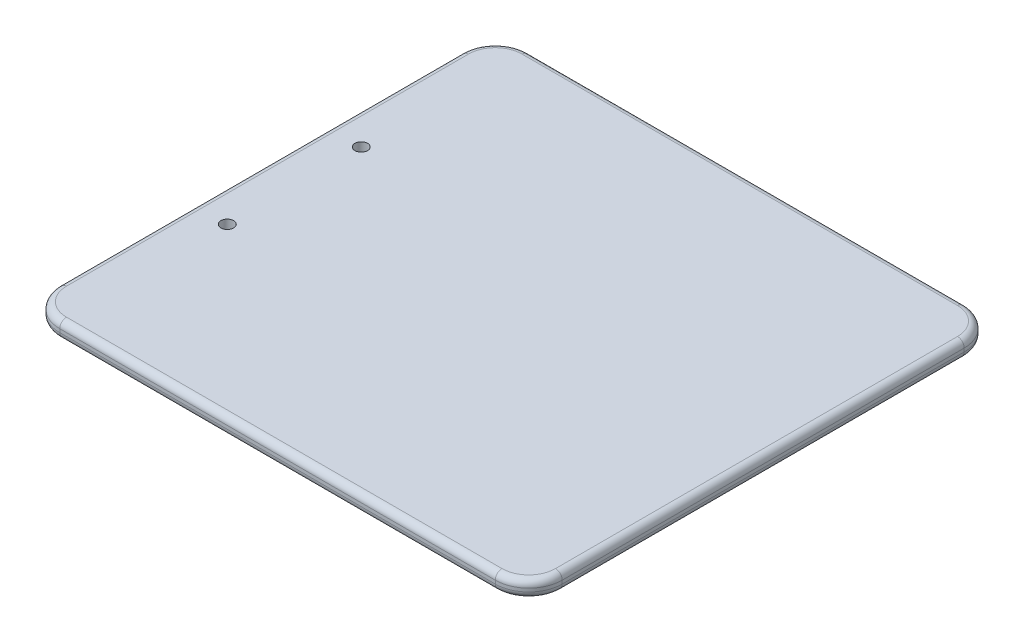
ISO-10303-21;
HEADER;
FILE_DESCRIPTION(('STEP AP214'),'2;1');
FILE_NAME('part.step','',(''),(''),'','','');
FILE_SCHEMA(('AUTOMOTIVE_DESIGN { 1 0 10303 214 1 1 1 1 }'));
ENDSEC;
DATA;
#1=APPLICATION_CONTEXT('core data for automotive mechanical design processes');
#2=APPLICATION_PROTOCOL_DEFINITION('international standard','automotive_design',2000,#1);
#3=PRODUCT_CONTEXT('',#1,'mechanical');
#4=PRODUCT('Part','Part','',(#3));
#5=PRODUCT_RELATED_PRODUCT_CATEGORY('part','',(#4));
#6=PRODUCT_DEFINITION_FORMATION('','',#4);
#7=PRODUCT_DEFINITION_CONTEXT('part definition',#1,'design');
#8=PRODUCT_DEFINITION('design','',#6,#7);
#9=PRODUCT_DEFINITION_SHAPE('','',#8);
#10=(LENGTH_UNIT() NAMED_UNIT(*) SI_UNIT(.MILLI.,.METRE.));
#11=(NAMED_UNIT(*) PLANE_ANGLE_UNIT() SI_UNIT($,.RADIAN.));
#12=(NAMED_UNIT(*) SI_UNIT($,.STERADIAN.) SOLID_ANGLE_UNIT());
#13=UNCERTAINTY_MEASURE_WITH_UNIT(LENGTH_MEASURE(1.E-05),#10,'distance_accuracy_value','');
#14=(GEOMETRIC_REPRESENTATION_CONTEXT(3) GLOBAL_UNCERTAINTY_ASSIGNED_CONTEXT((#13)) GLOBAL_UNIT_ASSIGNED_CONTEXT((#10,
#11,#12)) REPRESENTATION_CONTEXT('',''));
#15=CARTESIAN_POINT('',(0.,0.,0.));
#16=DIRECTION('',(0.,0.,1.));
#17=DIRECTION('',(1.,0.,0.));
#18=AXIS2_PLACEMENT_3D('',#15,#16,#17);
#19=CARTESIAN_POINT('',(75.,-5.,-70.));
#20=DIRECTION('',(0.,-1.,0.));
#21=DIRECTION('',(0.,0.,-1.));
#22=AXIS2_PLACEMENT_3D('',#19,#20,#21);
#23=PLANE('',#22);
#24=CARTESIAN_POINT('',(-65.,-5.,-20.));
#25=DIRECTION('',(0.,-1.,0.));
#26=DIRECTION('',(0.,0.,-1.));
#27=AXIS2_PLACEMENT_3D('',#24,#25,#26);
#28=CIRCLE('',#27,1.89865);
#29=CARTESIAN_POINT('',(-65.,-5.,-21.89865));
#30=VERTEX_POINT('',#29);
#31=EDGE_CURVE('E202',#30,#30,#28,.T.);
#32=ORIENTED_EDGE('',*,*,#31,.F.);
#33=EDGE_LOOP('',(#32));
#34=FACE_BOUND('',#33,.T.);
#35=CARTESIAN_POINT('',(-65.,-5.,20.));
#36=DIRECTION('',(0.,-1.,0.));
#37=DIRECTION('',(0.,0.,-1.));
#38=AXIS2_PLACEMENT_3D('',#35,#36,#37);
#39=CIRCLE('',#38,1.89865);
#40=CARTESIAN_POINT('',(-65.,-5.,18.10135));
#41=VERTEX_POINT('',#40);
#42=EDGE_CURVE('E319',#41,#41,#39,.T.);
#43=ORIENTED_EDGE('',*,*,#42,.F.);
#44=EDGE_LOOP('',(#43));
#45=FACE_BOUND('',#44,.T.);
#46=CARTESIAN_POINT('',(65.,-5.,60.));
#47=DIRECTION('',(0.,-1.,0.));
#48=DIRECTION('',(0.,0.,-1.));
#49=AXIS2_PLACEMENT_3D('',#46,#47,#48);
#50=CIRCLE('',#49,8.);
#51=CARTESIAN_POINT('',(65.,-5.,68.));
#52=VERTEX_POINT('',#51);
#53=CARTESIAN_POINT('',(73.,-5.,60.));
#54=VERTEX_POINT('',#53);
#55=EDGE_CURVE('E220',#52,#54,#50,.F.);
#56=ORIENTED_EDGE('',*,*,#55,.F.);
#57=DIRECTION('',(1.,0.,0.));
#58=VECTOR('',#57,1.);
#59=CARTESIAN_POINT('',(75.,-5.,68.));
#60=LINE('',#59,#58);
#61=CARTESIAN_POINT('',(-65.,-5.,68.));
#62=VERTEX_POINT('',#61);
#63=EDGE_CURVE('E281',#52,#62,#60,.F.);
#64=ORIENTED_EDGE('',*,*,#63,.T.);
#65=CARTESIAN_POINT('',(-65.,-5.,60.));
#66=DIRECTION('',(0.,-1.,0.));
#67=DIRECTION('',(0.,0.,-1.));
#68=AXIS2_PLACEMENT_3D('',#65,#66,#67);
#69=CIRCLE('',#68,8.);
#70=CARTESIAN_POINT('',(-73.,-5.,60.));
#71=VERTEX_POINT('',#70);
#72=EDGE_CURVE('E214',#71,#62,#69,.F.);
#73=ORIENTED_EDGE('',*,*,#72,.F.);
#74=DIRECTION('',(0.,0.,1.));
#75=VECTOR('',#74,1.);
#76=CARTESIAN_POINT('',(-73.,-5.,-70.));
#77=LINE('',#76,#75);
#78=CARTESIAN_POINT('',(-73.,-5.,-60.));
#79=VERTEX_POINT('',#78);
#80=EDGE_CURVE('E186',#71,#79,#77,.F.);
#81=ORIENTED_EDGE('',*,*,#80,.T.);
#82=CARTESIAN_POINT('',(-65.,-5.,-60.));
#83=DIRECTION('',(0.,-1.,0.));
#84=DIRECTION('',(0.,0.,-1.));
#85=AXIS2_PLACEMENT_3D('',#82,#83,#84);
#86=CIRCLE('',#85,8.);
#87=CARTESIAN_POINT('',(-65.,-5.,-68.));
#88=VERTEX_POINT('',#87);
#89=EDGE_CURVE('E192',#88,#79,#86,.F.);
#90=ORIENTED_EDGE('',*,*,#89,.F.);
#91=DIRECTION('',(-1.,0.,0.));
#92=VECTOR('',#91,1.);
#93=CARTESIAN_POINT('',(75.,-5.,-68.));
#94=LINE('',#93,#92);
#95=CARTESIAN_POINT('',(65.,-5.,-68.));
#96=VERTEX_POINT('',#95);
#97=EDGE_CURVE('E181',#88,#96,#94,.F.);
#98=ORIENTED_EDGE('',*,*,#97,.T.);
#99=CARTESIAN_POINT('',(65.,-5.,-60.));
#100=DIRECTION('',(0.,-1.,0.));
#101=DIRECTION('',(0.,0.,-1.));
#102=AXIS2_PLACEMENT_3D('',#99,#100,#101);
#103=CIRCLE('',#102,8.);
#104=CARTESIAN_POINT('',(73.,-5.,-60.));
#105=VERTEX_POINT('',#104);
#106=EDGE_CURVE('E217',#105,#96,#103,.F.);
#107=ORIENTED_EDGE('',*,*,#106,.F.);
#108=DIRECTION('',(0.,0.,-1.));
#109=VECTOR('',#108,1.);
#110=CARTESIAN_POINT('',(73.,-5.,-70.));
#111=LINE('',#110,#109);
#112=EDGE_CURVE('E287',#105,#54,#111,.F.);
#113=ORIENTED_EDGE('',*,*,#112,.T.);
#114=EDGE_LOOP('',(#56,#64,#73,#81,#90,#98,#107,#113));
#115=FACE_BOUND('',#114,.T.);
#116=ADVANCED_FACE('F35',(#34,#45,#115),#23,.T.);
#117=CARTESIAN_POINT('',(75.,0.,-70.));
#118=DIRECTION('',(0.,-1.,0.));
#119=DIRECTION('',(0.,0.,-1.));
#120=AXIS2_PLACEMENT_3D('',#117,#118,#119);
#121=PLANE('',#120);
#122=CARTESIAN_POINT('',(-65.,0.,-20.));
#123=DIRECTION('',(0.,-1.,0.));
#124=DIRECTION('',(0.,0.,-1.));
#125=AXIS2_PLACEMENT_3D('',#122,#123,#124);
#126=CIRCLE('',#125,1.89865);
#127=CARTESIAN_POINT('',(-65.,0.,-21.89865));
#128=VERTEX_POINT('',#127);
#129=EDGE_CURVE('E322',#128,#128,#126,.T.);
#130=ORIENTED_EDGE('',*,*,#129,.T.);
#131=EDGE_LOOP('',(#130));
#132=FACE_BOUND('',#131,.T.);
#133=CARTESIAN_POINT('',(-65.,0.,20.));
#134=DIRECTION('',(0.,-1.,0.));
#135=DIRECTION('',(0.,0.,-1.));
#136=AXIS2_PLACEMENT_3D('',#133,#134,#135);
#137=CIRCLE('',#136,1.89865);
#138=CARTESIAN_POINT('',(-65.,0.,18.10135));
#139=VERTEX_POINT('',#138);
#140=EDGE_CURVE('E316',#139,#139,#137,.T.);
#141=ORIENTED_EDGE('',*,*,#140,.T.);
#142=EDGE_LOOP('',(#141));
#143=FACE_BOUND('',#142,.T.);
#144=CARTESIAN_POINT('',(65.,0.,-60.));
#145=DIRECTION('',(0.,-1.,0.));
#146=DIRECTION('',(0.,0.,-1.));
#147=AXIS2_PLACEMENT_3D('',#144,#145,#146);
#148=CIRCLE('',#147,8.);
#149=CARTESIAN_POINT('',(65.,0.,-68.));
#150=VERTEX_POINT('',#149);
#151=CARTESIAN_POINT('',(73.,0.,-60.));
#152=VERTEX_POINT('',#151);
#153=EDGE_CURVE('E207',#150,#152,#148,.T.);
#154=ORIENTED_EDGE('',*,*,#153,.F.);
#155=DIRECTION('',(-1.,0.,0.));
#156=VECTOR('',#155,1.);
#157=CARTESIAN_POINT('',(-75.,0.,-68.));
#158=LINE('',#157,#156);
#159=CARTESIAN_POINT('',(-65.,0.,-68.));
#160=VERTEX_POINT('',#159);
#161=EDGE_CURVE('E311',#150,#160,#158,.T.);
#162=ORIENTED_EDGE('',*,*,#161,.T.);
#163=CARTESIAN_POINT('',(-65.,0.,-60.));
#164=DIRECTION('',(0.,-1.,0.));
#165=DIRECTION('',(0.,0.,-1.));
#166=AXIS2_PLACEMENT_3D('',#163,#164,#165);
#167=CIRCLE('',#166,8.);
#168=CARTESIAN_POINT('',(-73.,0.,-60.));
#169=VERTEX_POINT('',#168);
#170=EDGE_CURVE('E180',#169,#160,#167,.T.);
#171=ORIENTED_EDGE('',*,*,#170,.F.);
#172=DIRECTION('',(0.,0.,1.));
#173=VECTOR('',#172,1.);
#174=CARTESIAN_POINT('',(-73.,0.,70.));
#175=LINE('',#174,#173);
#176=CARTESIAN_POINT('',(-73.,0.,60.));
#177=VERTEX_POINT('',#176);
#178=EDGE_CURVE('E308',#169,#177,#175,.T.);
#179=ORIENTED_EDGE('',*,*,#178,.T.);
#180=CARTESIAN_POINT('',(-65.,0.,60.));
#181=DIRECTION('',(0.,-1.,0.));
#182=DIRECTION('',(0.,0.,-1.));
#183=AXIS2_PLACEMENT_3D('',#180,#181,#182);
#184=CIRCLE('',#183,8.);
#185=CARTESIAN_POINT('',(-65.,0.,68.));
#186=VERTEX_POINT('',#185);
#187=EDGE_CURVE('E205',#186,#177,#184,.T.);
#188=ORIENTED_EDGE('',*,*,#187,.F.);
#189=DIRECTION('',(1.,0.,0.));
#190=VECTOR('',#189,1.);
#191=CARTESIAN_POINT('',(75.,0.,68.));
#192=LINE('',#191,#190);
#193=CARTESIAN_POINT('',(65.,0.,68.));
#194=VERTEX_POINT('',#193);
#195=EDGE_CURVE('E305',#186,#194,#192,.T.);
#196=ORIENTED_EDGE('',*,*,#195,.T.);
#197=CARTESIAN_POINT('',(65.,0.,60.));
#198=DIRECTION('',(0.,-1.,0.));
#199=DIRECTION('',(0.,0.,-1.));
#200=AXIS2_PLACEMENT_3D('',#197,#198,#199);
#201=CIRCLE('',#200,8.);
#202=CARTESIAN_POINT('',(73.,0.,60.));
#203=VERTEX_POINT('',#202);
#204=EDGE_CURVE('E199',#203,#194,#201,.T.);
#205=ORIENTED_EDGE('',*,*,#204,.F.);
#206=DIRECTION('',(0.,0.,-1.));
#207=VECTOR('',#206,1.);
#208=CARTESIAN_POINT('',(73.,0.,-70.));
#209=LINE('',#208,#207);
#210=EDGE_CURVE('E313',#203,#152,#209,.T.);
#211=ORIENTED_EDGE('',*,*,#210,.T.);
#212=EDGE_LOOP('',(#154,#162,#171,#179,#188,#196,#205,#211));
#213=FACE_BOUND('',#212,.T.);
#214=ADVANCED_FACE('F332',(#132,#143,#213),#121,.F.);
#215=CARTESIAN_POINT('',(75.,-5.,70.));
#216=DIRECTION('',(1.,0.,0.));
#217=DIRECTION('',(0.,0.,-1.));
#218=AXIS2_PLACEMENT_3D('',#215,#216,#217);
#219=PLANE('',#218);
#220=DIRECTION('',(0.,0.,-1.));
#221=VECTOR('',#220,1.);
#222=CARTESIAN_POINT('',(75.,-2.,70.));
#223=LINE('',#222,#221);
#224=CARTESIAN_POINT('',(75.,-2.,-60.));
#225=VERTEX_POINT('',#224);
#226=CARTESIAN_POINT('',(75.,-2.,60.));
#227=VERTEX_POINT('',#226);
#228=EDGE_CURVE('E289',#225,#227,#223,.F.);
#229=ORIENTED_EDGE('',*,*,#228,.T.);
#230=DIRECTION('',(0.,1.,0.));
#231=VECTOR('',#230,1.);
#232=CARTESIAN_POINT('',(75.,-5.,60.));
#233=LINE('',#232,#231);
#234=CARTESIAN_POINT('',(75.,-3.,60.));
#235=VERTEX_POINT('',#234);
#236=EDGE_CURVE('E249',#227,#235,#233,.F.);
#237=ORIENTED_EDGE('',*,*,#236,.T.);
#238=DIRECTION('',(0.,0.,-1.));
#239=VECTOR('',#238,1.);
#240=CARTESIAN_POINT('',(75.,-3.,70.));
#241=LINE('',#240,#239);
#242=CARTESIAN_POINT('',(75.,-3.,-60.));
#243=VERTEX_POINT('',#242);
#244=EDGE_CURVE('E167',#235,#243,#241,.T.);
#245=ORIENTED_EDGE('',*,*,#244,.T.);
#246=DIRECTION('',(0.,1.,0.));
#247=VECTOR('',#246,1.);
#248=CARTESIAN_POINT('',(75.,-5.,-60.));
#249=LINE('',#248,#247);
#250=EDGE_CURVE('E247',#243,#225,#249,.T.);
#251=ORIENTED_EDGE('',*,*,#250,.T.);
#252=EDGE_LOOP('',(#229,#237,#245,#251));
#253=FACE_BOUND('',#252,.T.);
#254=ADVANCED_FACE('F355',(#253),#219,.T.);
#255=CARTESIAN_POINT('',(-75.,-5.,70.));
#256=DIRECTION('',(0.,0.,1.));
#257=DIRECTION('',(1.,0.,0.));
#258=AXIS2_PLACEMENT_3D('',#255,#256,#257);
#259=PLANE('',#258);
#260=DIRECTION('',(1.,0.,0.));
#261=VECTOR('',#260,1.);
#262=CARTESIAN_POINT('',(-75.,-2.,70.));
#263=LINE('',#262,#261);
#264=CARTESIAN_POINT('',(65.,-2.,70.));
#265=VERTEX_POINT('',#264);
#266=CARTESIAN_POINT('',(-65.,-2.,70.));
#267=VERTEX_POINT('',#266);
#268=EDGE_CURVE('E301',#265,#267,#263,.F.);
#269=ORIENTED_EDGE('',*,*,#268,.T.);
#270=DIRECTION('',(0.,1.,0.));
#271=VECTOR('',#270,1.);
#272=CARTESIAN_POINT('',(-65.,-5.,70.));
#273=LINE('',#272,#271);
#274=CARTESIAN_POINT('',(-65.,-3.,70.));
#275=VERTEX_POINT('',#274);
#276=EDGE_CURVE('E245',#267,#275,#273,.F.);
#277=ORIENTED_EDGE('',*,*,#276,.T.);
#278=DIRECTION('',(1.,0.,0.));
#279=VECTOR('',#278,1.);
#280=CARTESIAN_POINT('',(-75.,-3.,70.));
#281=LINE('',#280,#279);
#282=CARTESIAN_POINT('',(65.,-3.,70.));
#283=VERTEX_POINT('',#282);
#284=EDGE_CURVE('E283',#275,#283,#281,.T.);
#285=ORIENTED_EDGE('',*,*,#284,.T.);
#286=DIRECTION('',(0.,1.,0.));
#287=VECTOR('',#286,1.);
#288=CARTESIAN_POINT('',(65.,-5.,70.));
#289=LINE('',#288,#287);
#290=EDGE_CURVE('E243',#283,#265,#289,.T.);
#291=ORIENTED_EDGE('',*,*,#290,.T.);
#292=EDGE_LOOP('',(#269,#277,#285,#291));
#293=FACE_BOUND('',#292,.T.);
#294=ADVANCED_FACE('F357',(#293),#259,.T.);
#295=CARTESIAN_POINT('',(-75.,-5.,70.));
#296=DIRECTION('',(-1.,0.,0.));
#297=DIRECTION('',(0.,0.,1.));
#298=AXIS2_PLACEMENT_3D('',#295,#296,#297);
#299=PLANE('',#298);
#300=DIRECTION('',(0.,0.,1.));
#301=VECTOR('',#300,1.);
#302=CARTESIAN_POINT('',(-75.,-3.,70.));
#303=LINE('',#302,#301);
#304=CARTESIAN_POINT('',(-75.,-3.,-60.));
#305=VERTEX_POINT('',#304);
#306=CARTESIAN_POINT('',(-75.,-3.,60.));
#307=VERTEX_POINT('',#306);
#308=EDGE_CURVE('E299',#305,#307,#303,.T.);
#309=ORIENTED_EDGE('',*,*,#308,.T.);
#310=DIRECTION('',(0.,1.,0.));
#311=VECTOR('',#310,1.);
#312=CARTESIAN_POINT('',(-75.,-5.,60.));
#313=LINE('',#312,#311);
#314=CARTESIAN_POINT('',(-75.,-2.,60.));
#315=VERTEX_POINT('',#314);
#316=EDGE_CURVE('E241',#307,#315,#313,.T.);
#317=ORIENTED_EDGE('',*,*,#316,.T.);
#318=DIRECTION('',(0.,0.,1.));
#319=VECTOR('',#318,1.);
#320=CARTESIAN_POINT('',(-75.,-2.,-70.));
#321=LINE('',#320,#319);
#322=CARTESIAN_POINT('',(-75.,-2.,-60.));
#323=VERTEX_POINT('',#322);
#324=EDGE_CURVE('E297',#315,#323,#321,.F.);
#325=ORIENTED_EDGE('',*,*,#324,.T.);
#326=DIRECTION('',(0.,1.,0.));
#327=VECTOR('',#326,1.);
#328=CARTESIAN_POINT('',(-75.,-5.,-60.));
#329=LINE('',#328,#327);
#330=EDGE_CURVE('E160',#323,#305,#329,.F.);
#331=ORIENTED_EDGE('',*,*,#330,.T.);
#332=EDGE_LOOP('',(#309,#317,#325,#331));
#333=FACE_BOUND('',#332,.T.);
#334=ADVANCED_FACE('F360',(#333),#299,.T.);
#335=CARTESIAN_POINT('',(-75.,-5.,-70.));
#336=DIRECTION('',(0.,0.,-1.));
#337=DIRECTION('',(-1.,0.,0.));
#338=AXIS2_PLACEMENT_3D('',#335,#336,#337);
#339=PLANE('',#338);
#340=DIRECTION('',(-1.,0.,0.));
#341=VECTOR('',#340,1.);
#342=CARTESIAN_POINT('',(75.,-2.,-70.));
#343=LINE('',#342,#341);
#344=CARTESIAN_POINT('',(-65.,-2.,-70.));
#345=VERTEX_POINT('',#344);
#346=CARTESIAN_POINT('',(65.,-2.,-70.));
#347=VERTEX_POINT('',#346);
#348=EDGE_CURVE('E152',#345,#347,#343,.F.);
#349=ORIENTED_EDGE('',*,*,#348,.T.);
#350=DIRECTION('',(0.,1.,0.));
#351=VECTOR('',#350,1.);
#352=CARTESIAN_POINT('',(65.,-5.,-70.));
#353=LINE('',#352,#351);
#354=CARTESIAN_POINT('',(65.,-3.,-70.));
#355=VERTEX_POINT('',#354);
#356=EDGE_CURVE('E44',#347,#355,#353,.F.);
#357=ORIENTED_EDGE('',*,*,#356,.T.);
#358=DIRECTION('',(-1.,0.,0.));
#359=VECTOR('',#358,1.);
#360=CARTESIAN_POINT('',(-75.,-3.,-70.));
#361=LINE('',#360,#359);
#362=CARTESIAN_POINT('',(-65.,-3.,-70.));
#363=VERTEX_POINT('',#362);
#364=EDGE_CURVE('E155',#355,#363,#361,.T.);
#365=ORIENTED_EDGE('',*,*,#364,.T.);
#366=DIRECTION('',(0.,1.,0.));
#367=VECTOR('',#366,1.);
#368=CARTESIAN_POINT('',(-65.,-5.,-70.));
#369=LINE('',#368,#367);
#370=EDGE_CURVE('E150',#363,#345,#369,.T.);
#371=ORIENTED_EDGE('',*,*,#370,.T.);
#372=EDGE_LOOP('',(#349,#357,#365,#371));
#373=FACE_BOUND('',#372,.T.);
#374=ADVANCED_FACE('F151',(#373),#339,.T.);
#375=CARTESIAN_POINT('',(75.,-2.,-68.));
#376=DIRECTION('',(1.,0.,0.));
#377=DIRECTION('',(0.,0.,-1.));
#378=AXIS2_PLACEMENT_3D('',#375,#376,#377);
#379=CYLINDRICAL_SURFACE('',#378,2.);
#380=ORIENTED_EDGE('',*,*,#161,.F.);
#381=CARTESIAN_POINT('',(65.,-2.,-68.));
#382=DIRECTION('',(-1.,0.,0.));
#383=DIRECTION('',(0.,0.,1.));
#384=AXIS2_PLACEMENT_3D('',#381,#382,#383);
#385=CIRCLE('',#384,2.);
#386=EDGE_CURVE('E11',#150,#347,#385,.T.);
#387=ORIENTED_EDGE('',*,*,#386,.T.);
#388=ORIENTED_EDGE('',*,*,#348,.F.);
#389=CARTESIAN_POINT('',(-65.,-2.,-68.));
#390=DIRECTION('',(1.,0.,0.));
#391=DIRECTION('',(0.,0.,-1.));
#392=AXIS2_PLACEMENT_3D('',#389,#390,#391);
#393=CIRCLE('',#392,2.);
#394=EDGE_CURVE('E166',#345,#160,#393,.T.);
#395=ORIENTED_EDGE('',*,*,#394,.T.);
#396=EDGE_LOOP('',(#380,#387,#388,#395));
#397=FACE_BOUND('',#396,.T.);
#398=ADVANCED_FACE('F164',(#397),#379,.T.);
#399=CARTESIAN_POINT('',(-73.,-2.,-70.));
#400=DIRECTION('',(0.,0.,-1.));
#401=DIRECTION('',(-1.,0.,0.));
#402=AXIS2_PLACEMENT_3D('',#399,#400,#401);
#403=CYLINDRICAL_SURFACE('',#402,2.);
#404=ORIENTED_EDGE('',*,*,#324,.F.);
#405=CARTESIAN_POINT('',(-73.,-2.,60.));
#406=DIRECTION('',(0.,0.,-1.));
#407=DIRECTION('',(-1.,0.,0.));
#408=AXIS2_PLACEMENT_3D('',#405,#406,#407);
#409=CIRCLE('',#408,2.);
#410=EDGE_CURVE('E227',#315,#177,#409,.T.);
#411=ORIENTED_EDGE('',*,*,#410,.T.);
#412=ORIENTED_EDGE('',*,*,#178,.F.);
#413=CARTESIAN_POINT('',(-73.,-2.,-60.));
#414=DIRECTION('',(0.,0.,1.));
#415=DIRECTION('',(1.,0.,0.));
#416=AXIS2_PLACEMENT_3D('',#413,#414,#415);
#417=CIRCLE('',#416,2.);
#418=EDGE_CURVE('E197',#169,#323,#417,.T.);
#419=ORIENTED_EDGE('',*,*,#418,.T.);
#420=EDGE_LOOP('',(#404,#411,#412,#419));
#421=FACE_BOUND('',#420,.T.);
#422=ADVANCED_FACE('F377',(#421),#403,.T.);
#423=CARTESIAN_POINT('',(73.,-2.,-70.));
#424=DIRECTION('',(0.,0.,1.));
#425=DIRECTION('',(1.,0.,0.));
#426=AXIS2_PLACEMENT_3D('',#423,#424,#425);
#427=CYLINDRICAL_SURFACE('',#426,2.);
#428=ORIENTED_EDGE('',*,*,#228,.F.);
#429=CARTESIAN_POINT('',(73.,-2.,-60.));
#430=DIRECTION('',(0.,0.,1.));
#431=DIRECTION('',(1.,0.,0.));
#432=AXIS2_PLACEMENT_3D('',#429,#430,#431);
#433=CIRCLE('',#432,2.);
#434=EDGE_CURVE('E212',#225,#152,#433,.T.);
#435=ORIENTED_EDGE('',*,*,#434,.T.);
#436=ORIENTED_EDGE('',*,*,#210,.F.);
#437=CARTESIAN_POINT('',(73.,-2.,60.));
#438=DIRECTION('',(0.,0.,-1.));
#439=DIRECTION('',(-1.,0.,0.));
#440=AXIS2_PLACEMENT_3D('',#437,#438,#439);
#441=CIRCLE('',#440,2.);
#442=EDGE_CURVE('E210',#203,#227,#441,.T.);
#443=ORIENTED_EDGE('',*,*,#442,.T.);
#444=EDGE_LOOP('',(#428,#435,#436,#443));
#445=FACE_BOUND('',#444,.T.);
#446=ADVANCED_FACE('F373',(#445),#427,.T.);
#447=CARTESIAN_POINT('',(75.,-2.,68.));
#448=DIRECTION('',(-1.,0.,0.));
#449=DIRECTION('',(0.,0.,1.));
#450=AXIS2_PLACEMENT_3D('',#447,#448,#449);
#451=CYLINDRICAL_SURFACE('',#450,2.);
#452=ORIENTED_EDGE('',*,*,#268,.F.);
#453=CARTESIAN_POINT('',(65.,-2.,68.));
#454=DIRECTION('',(-1.,0.,0.));
#455=DIRECTION('',(0.,0.,1.));
#456=AXIS2_PLACEMENT_3D('',#453,#454,#455);
#457=CIRCLE('',#456,2.);
#458=EDGE_CURVE('E234',#265,#194,#457,.T.);
#459=ORIENTED_EDGE('',*,*,#458,.T.);
#460=ORIENTED_EDGE('',*,*,#195,.F.);
#461=CARTESIAN_POINT('',(-65.,-2.,68.));
#462=DIRECTION('',(1.,0.,0.));
#463=DIRECTION('',(0.,0.,-1.));
#464=AXIS2_PLACEMENT_3D('',#461,#462,#463);
#465=CIRCLE('',#464,2.);
#466=EDGE_CURVE('E232',#186,#267,#465,.T.);
#467=ORIENTED_EDGE('',*,*,#466,.T.);
#468=EDGE_LOOP('',(#452,#459,#460,#467));
#469=FACE_BOUND('',#468,.T.);
#470=ADVANCED_FACE('F370',(#469),#451,.T.);
#471=CARTESIAN_POINT('',(-75.,-3.,68.));
#472=DIRECTION('',(1.,0.,0.));
#473=DIRECTION('',(0.,0.,-1.));
#474=AXIS2_PLACEMENT_3D('',#471,#472,#473);
#475=CYLINDRICAL_SURFACE('',#474,2.);
#476=ORIENTED_EDGE('',*,*,#284,.F.);
#477=CARTESIAN_POINT('',(-65.,-3.,68.));
#478=DIRECTION('',(1.,0.,0.));
#479=DIRECTION('',(0.,0.,-1.));
#480=AXIS2_PLACEMENT_3D('',#477,#478,#479);
#481=CIRCLE('',#480,2.);
#482=EDGE_CURVE('E238',#275,#62,#481,.T.);
#483=ORIENTED_EDGE('',*,*,#482,.T.);
#484=ORIENTED_EDGE('',*,*,#63,.F.);
#485=CARTESIAN_POINT('',(65.,-3.,68.));
#486=DIRECTION('',(-1.,0.,0.));
#487=DIRECTION('',(0.,0.,1.));
#488=AXIS2_PLACEMENT_3D('',#485,#486,#487);
#489=CIRCLE('',#488,2.);
#490=EDGE_CURVE('E236',#52,#283,#489,.T.);
#491=ORIENTED_EDGE('',*,*,#490,.T.);
#492=EDGE_LOOP('',(#476,#483,#484,#491));
#493=FACE_BOUND('',#492,.T.);
#494=ADVANCED_FACE('F280',(#493),#475,.T.);
#495=CARTESIAN_POINT('',(73.,-3.,70.));
#496=DIRECTION('',(0.,0.,-1.));
#497=DIRECTION('',(-1.,0.,0.));
#498=AXIS2_PLACEMENT_3D('',#495,#496,#497);
#499=CYLINDRICAL_SURFACE('',#498,2.);
#500=ORIENTED_EDGE('',*,*,#244,.F.);
#501=CARTESIAN_POINT('',(73.,-3.,60.));
#502=DIRECTION('',(0.,0.,-1.));
#503=DIRECTION('',(-1.,0.,0.));
#504=AXIS2_PLACEMENT_3D('',#501,#502,#503);
#505=CIRCLE('',#504,2.);
#506=EDGE_CURVE('E225',#235,#54,#505,.T.);
#507=ORIENTED_EDGE('',*,*,#506,.T.);
#508=ORIENTED_EDGE('',*,*,#112,.F.);
#509=CARTESIAN_POINT('',(73.,-3.,-60.));
#510=DIRECTION('',(0.,0.,1.));
#511=DIRECTION('',(1.,0.,0.));
#512=AXIS2_PLACEMENT_3D('',#509,#510,#511);
#513=CIRCLE('',#512,2.);
#514=EDGE_CURVE('E223',#105,#243,#513,.T.);
#515=ORIENTED_EDGE('',*,*,#514,.T.);
#516=EDGE_LOOP('',(#500,#507,#508,#515));
#517=FACE_BOUND('',#516,.T.);
#518=ADVANCED_FACE('F386',(#517),#499,.T.);
#519=CARTESIAN_POINT('',(-73.,-3.,70.));
#520=DIRECTION('',(0.,0.,1.));
#521=DIRECTION('',(1.,0.,0.));
#522=AXIS2_PLACEMENT_3D('',#519,#520,#521);
#523=CYLINDRICAL_SURFACE('',#522,2.);
#524=ORIENTED_EDGE('',*,*,#80,.F.);
#525=CARTESIAN_POINT('',(-73.,-3.,60.));
#526=DIRECTION('',(0.,0.,-1.));
#527=DIRECTION('',(-1.,0.,0.));
#528=AXIS2_PLACEMENT_3D('',#525,#526,#527);
#529=CIRCLE('',#528,2.);
#530=EDGE_CURVE('E58',#71,#307,#529,.T.);
#531=ORIENTED_EDGE('',*,*,#530,.T.);
#532=ORIENTED_EDGE('',*,*,#308,.F.);
#533=CARTESIAN_POINT('',(-73.,-3.,-60.));
#534=DIRECTION('',(0.,0.,1.));
#535=DIRECTION('',(1.,0.,0.));
#536=AXIS2_PLACEMENT_3D('',#533,#534,#535);
#537=CIRCLE('',#536,2.);
#538=EDGE_CURVE('E183',#305,#79,#537,.T.);
#539=ORIENTED_EDGE('',*,*,#538,.T.);
#540=EDGE_LOOP('',(#524,#531,#532,#539));
#541=FACE_BOUND('',#540,.T.);
#542=ADVANCED_FACE('F348',(#541),#523,.T.);
#543=CARTESIAN_POINT('',(-75.,-3.,-68.));
#544=DIRECTION('',(-1.,0.,0.));
#545=DIRECTION('',(0.,0.,1.));
#546=AXIS2_PLACEMENT_3D('',#543,#544,#545);
#547=CYLINDRICAL_SURFACE('',#546,2.);
#548=ORIENTED_EDGE('',*,*,#364,.F.);
#549=CARTESIAN_POINT('',(65.,-3.,-68.));
#550=DIRECTION('',(-1.,0.,0.));
#551=DIRECTION('',(0.,0.,1.));
#552=AXIS2_PLACEMENT_3D('',#549,#550,#551);
#553=CIRCLE('',#552,2.);
#554=EDGE_CURVE('E230',#355,#96,#553,.T.);
#555=ORIENTED_EDGE('',*,*,#554,.T.);
#556=ORIENTED_EDGE('',*,*,#97,.F.);
#557=CARTESIAN_POINT('',(-65.,-3.,-68.));
#558=DIRECTION('',(1.,0.,0.));
#559=DIRECTION('',(0.,0.,-1.));
#560=AXIS2_PLACEMENT_3D('',#557,#558,#559);
#561=CIRCLE('',#560,2.);
#562=EDGE_CURVE('E161',#88,#363,#561,.T.);
#563=ORIENTED_EDGE('',*,*,#562,.T.);
#564=EDGE_LOOP('',(#548,#555,#556,#563));
#565=FACE_BOUND('',#564,.T.);
#566=ADVANCED_FACE('F338',(#565),#547,.T.);
#567=CARTESIAN_POINT('',(-65.,-5.,20.));
#568=DIRECTION('',(0.,-1.,0.));
#569=DIRECTION('',(0.,0.,-1.));
#570=AXIS2_PLACEMENT_3D('',#567,#568,#569);
#571=CYLINDRICAL_SURFACE('',#570,1.89865);
#572=ORIENTED_EDGE('',*,*,#140,.F.);
#573=EDGE_LOOP('',(#572));
#574=FACE_BOUND('',#573,.T.);
#575=ORIENTED_EDGE('',*,*,#42,.T.);
#576=EDGE_LOOP('',(#575));
#577=FACE_BOUND('',#576,.T.);
#578=ADVANCED_FACE('F336',(#574,#577),#571,.F.);
#579=CARTESIAN_POINT('',(-65.,-5.,-20.));
#580=DIRECTION('',(0.,-1.,0.));
#581=DIRECTION('',(0.,0.,-1.));
#582=AXIS2_PLACEMENT_3D('',#579,#580,#581);
#583=CYLINDRICAL_SURFACE('',#582,1.89865);
#584=ORIENTED_EDGE('',*,*,#129,.F.);
#585=EDGE_LOOP('',(#584));
#586=FACE_BOUND('',#585,.T.);
#587=ORIENTED_EDGE('',*,*,#31,.T.);
#588=EDGE_LOOP('',(#587));
#589=FACE_BOUND('',#588,.T.);
#590=ADVANCED_FACE('F328',(#586,#589),#583,.F.);
#591=CARTESIAN_POINT('',(-65.,-3.,-60.));
#592=DIRECTION('',(0.,-1.,0.));
#593=DIRECTION('',(0.,0.,-1.));
#594=AXIS2_PLACEMENT_3D('',#591,#592,#593);
#595=TOROIDAL_SURFACE('',#594,8.,2.);
#596=ORIENTED_EDGE('',*,*,#89,.T.);
#597=ORIENTED_EDGE('',*,*,#538,.F.);
#598=CARTESIAN_POINT('',(-65.,-3.,-60.));
#599=DIRECTION('',(0.,-1.,0.));
#600=DIRECTION('',(0.,0.,-1.));
#601=AXIS2_PLACEMENT_3D('',#598,#599,#600);
#602=CIRCLE('',#601,10.);
#603=EDGE_CURVE('E175',#363,#305,#602,.F.);
#604=ORIENTED_EDGE('',*,*,#603,.F.);
#605=ORIENTED_EDGE('',*,*,#562,.F.);
#606=EDGE_LOOP('',(#596,#597,#604,#605));
#607=FACE_BOUND('',#606,.T.);
#608=ADVANCED_FACE('F345',(#607),#595,.T.);
#609=CARTESIAN_POINT('',(-65.,-5.,-60.));
#610=DIRECTION('',(0.,1.,0.));
#611=DIRECTION('',(0.,0.,1.));
#612=AXIS2_PLACEMENT_3D('',#609,#610,#611);
#613=CYLINDRICAL_SURFACE('',#612,10.);
#614=ORIENTED_EDGE('',*,*,#603,.T.);
#615=ORIENTED_EDGE('',*,*,#330,.F.);
#616=CARTESIAN_POINT('',(-65.,-2.,-60.));
#617=DIRECTION('',(0.,-1.,0.));
#618=DIRECTION('',(0.,0.,-1.));
#619=AXIS2_PLACEMENT_3D('',#616,#617,#618);
#620=CIRCLE('',#619,10.);
#621=EDGE_CURVE('E171',#345,#323,#620,.F.);
#622=ORIENTED_EDGE('',*,*,#621,.F.);
#623=ORIENTED_EDGE('',*,*,#370,.F.);
#624=EDGE_LOOP('',(#614,#615,#622,#623));
#625=FACE_BOUND('',#624,.T.);
#626=ADVANCED_FACE('F172',(#625),#613,.T.);
#627=CARTESIAN_POINT('',(-65.,-2.,-60.));
#628=DIRECTION('',(0.,-1.,0.));
#629=DIRECTION('',(0.,0.,-1.));
#630=AXIS2_PLACEMENT_3D('',#627,#628,#629);
#631=TOROIDAL_SURFACE('',#630,8.,2.);
#632=ORIENTED_EDGE('',*,*,#394,.F.);
#633=ORIENTED_EDGE('',*,*,#621,.T.);
#634=ORIENTED_EDGE('',*,*,#418,.F.);
#635=ORIENTED_EDGE('',*,*,#170,.T.);
#636=EDGE_LOOP('',(#632,#633,#634,#635));
#637=FACE_BOUND('',#636,.T.);
#638=ADVANCED_FACE('F179',(#637),#631,.T.);
#639=CARTESIAN_POINT('',(65.,-3.,-60.));
#640=DIRECTION('',(0.,-1.,0.));
#641=DIRECTION('',(0.,0.,-1.));
#642=AXIS2_PLACEMENT_3D('',#639,#640,#641);
#643=TOROIDAL_SURFACE('',#642,8.,2.);
#644=ORIENTED_EDGE('',*,*,#106,.T.);
#645=ORIENTED_EDGE('',*,*,#554,.F.);
#646=CARTESIAN_POINT('',(65.,-3.,-60.));
#647=DIRECTION('',(0.,-1.,0.));
#648=DIRECTION('',(0.,0.,-1.));
#649=AXIS2_PLACEMENT_3D('',#646,#647,#648);
#650=CIRCLE('',#649,10.);
#651=EDGE_CURVE('E176',#243,#355,#650,.F.);
#652=ORIENTED_EDGE('',*,*,#651,.F.);
#653=ORIENTED_EDGE('',*,*,#514,.F.);
#654=EDGE_LOOP('',(#644,#645,#652,#653));
#655=FACE_BOUND('',#654,.T.);
#656=ADVANCED_FACE('F394',(#655),#643,.T.);
#657=CARTESIAN_POINT('',(65.,-5.,-60.));
#658=DIRECTION('',(0.,1.,0.));
#659=DIRECTION('',(0.,0.,1.));
#660=AXIS2_PLACEMENT_3D('',#657,#658,#659);
#661=CYLINDRICAL_SURFACE('',#660,10.);
#662=ORIENTED_EDGE('',*,*,#651,.T.);
#663=ORIENTED_EDGE('',*,*,#356,.F.);
#664=CARTESIAN_POINT('',(65.,-2.,-60.));
#665=DIRECTION('',(0.,-1.,0.));
#666=DIRECTION('',(0.,0.,-1.));
#667=AXIS2_PLACEMENT_3D('',#664,#665,#666);
#668=CIRCLE('',#667,10.);
#669=EDGE_CURVE('E252',#225,#347,#668,.F.);
#670=ORIENTED_EDGE('',*,*,#669,.F.);
#671=ORIENTED_EDGE('',*,*,#250,.F.);
#672=EDGE_LOOP('',(#662,#663,#670,#671));
#673=FACE_BOUND('',#672,.T.);
#674=ADVANCED_FACE('F404',(#673),#661,.T.);
#675=CARTESIAN_POINT('',(65.,-2.,-60.));
#676=DIRECTION('',(0.,-1.,0.));
#677=DIRECTION('',(0.,0.,-1.));
#678=AXIS2_PLACEMENT_3D('',#675,#676,#677);
#679=TOROIDAL_SURFACE('',#678,8.,2.);
#680=ORIENTED_EDGE('',*,*,#386,.F.);
#681=ORIENTED_EDGE('',*,*,#153,.T.);
#682=ORIENTED_EDGE('',*,*,#434,.F.);
#683=ORIENTED_EDGE('',*,*,#669,.T.);
#684=EDGE_LOOP('',(#680,#681,#682,#683));
#685=FACE_BOUND('',#684,.T.);
#686=ADVANCED_FACE('F400',(#685),#679,.T.);
#687=CARTESIAN_POINT('',(65.,-2.,60.));
#688=DIRECTION('',(0.,-1.,0.));
#689=DIRECTION('',(0.,0.,-1.));
#690=AXIS2_PLACEMENT_3D('',#687,#688,#689);
#691=TOROIDAL_SURFACE('',#690,8.,2.);
#692=ORIENTED_EDGE('',*,*,#204,.T.);
#693=ORIENTED_EDGE('',*,*,#458,.F.);
#694=CARTESIAN_POINT('',(65.,-2.,60.));
#695=DIRECTION('',(0.,-1.,0.));
#696=DIRECTION('',(0.,0.,-1.));
#697=AXIS2_PLACEMENT_3D('',#694,#695,#696);
#698=CIRCLE('',#697,10.);
#699=EDGE_CURVE('E255',#227,#265,#698,.T.);
#700=ORIENTED_EDGE('',*,*,#699,.F.);
#701=ORIENTED_EDGE('',*,*,#442,.F.);
#702=EDGE_LOOP('',(#692,#693,#700,#701));
#703=FACE_BOUND('',#702,.T.);
#704=ADVANCED_FACE('F403',(#703),#691,.T.);
#705=CARTESIAN_POINT('',(65.,-5.,60.));
#706=DIRECTION('',(0.,1.,0.));
#707=DIRECTION('',(0.,0.,1.));
#708=AXIS2_PLACEMENT_3D('',#705,#706,#707);
#709=CYLINDRICAL_SURFACE('',#708,10.);
#710=ORIENTED_EDGE('',*,*,#699,.T.);
#711=ORIENTED_EDGE('',*,*,#290,.F.);
#712=CARTESIAN_POINT('',(65.,-3.,60.));
#713=DIRECTION('',(0.,-1.,0.));
#714=DIRECTION('',(0.,0.,-1.));
#715=AXIS2_PLACEMENT_3D('',#712,#713,#714);
#716=CIRCLE('',#715,10.);
#717=EDGE_CURVE('E258',#235,#283,#716,.T.);
#718=ORIENTED_EDGE('',*,*,#717,.F.);
#719=ORIENTED_EDGE('',*,*,#236,.F.);
#720=EDGE_LOOP('',(#710,#711,#718,#719));
#721=FACE_BOUND('',#720,.T.);
#722=ADVANCED_FACE('F415',(#721),#709,.T.);
#723=CARTESIAN_POINT('',(65.,-3.,60.));
#724=DIRECTION('',(0.,-1.,0.));
#725=DIRECTION('',(0.,0.,-1.));
#726=AXIS2_PLACEMENT_3D('',#723,#724,#725);
#727=TOROIDAL_SURFACE('',#726,8.,2.);
#728=ORIENTED_EDGE('',*,*,#490,.F.);
#729=ORIENTED_EDGE('',*,*,#55,.T.);
#730=ORIENTED_EDGE('',*,*,#506,.F.);
#731=ORIENTED_EDGE('',*,*,#717,.T.);
#732=EDGE_LOOP('',(#728,#729,#730,#731));
#733=FACE_BOUND('',#732,.T.);
#734=ADVANCED_FACE('F412',(#733),#727,.T.);
#735=CARTESIAN_POINT('',(-65.,-3.,60.));
#736=DIRECTION('',(0.,-1.,0.));
#737=DIRECTION('',(0.,0.,-1.));
#738=AXIS2_PLACEMENT_3D('',#735,#736,#737);
#739=TOROIDAL_SURFACE('',#738,8.,2.);
#740=ORIENTED_EDGE('',*,*,#72,.T.);
#741=ORIENTED_EDGE('',*,*,#482,.F.);
#742=CARTESIAN_POINT('',(-65.,-3.,60.));
#743=DIRECTION('',(0.,-1.,0.));
#744=DIRECTION('',(0.,0.,-1.));
#745=AXIS2_PLACEMENT_3D('',#742,#743,#744);
#746=CIRCLE('',#745,10.);
#747=EDGE_CURVE('E39',#307,#275,#746,.F.);
#748=ORIENTED_EDGE('',*,*,#747,.F.);
#749=ORIENTED_EDGE('',*,*,#530,.F.);
#750=EDGE_LOOP('',(#740,#741,#748,#749));
#751=FACE_BOUND('',#750,.T.);
#752=ADVANCED_FACE('F37',(#751),#739,.T.);
#753=CARTESIAN_POINT('',(-65.,-5.,60.));
#754=DIRECTION('',(0.,1.,0.));
#755=DIRECTION('',(0.,0.,1.));
#756=AXIS2_PLACEMENT_3D('',#753,#754,#755);
#757=CYLINDRICAL_SURFACE('',#756,10.);
#758=ORIENTED_EDGE('',*,*,#747,.T.);
#759=ORIENTED_EDGE('',*,*,#276,.F.);
#760=CARTESIAN_POINT('',(-65.,-2.,60.));
#761=DIRECTION('',(0.,-1.,0.));
#762=DIRECTION('',(0.,0.,-1.));
#763=AXIS2_PLACEMENT_3D('',#760,#761,#762);
#764=CIRCLE('',#763,10.);
#765=EDGE_CURVE('E262',#315,#267,#764,.F.);
#766=ORIENTED_EDGE('',*,*,#765,.F.);
#767=ORIENTED_EDGE('',*,*,#316,.F.);
#768=EDGE_LOOP('',(#758,#759,#766,#767));
#769=FACE_BOUND('',#768,.T.);
#770=ADVANCED_FACE('F273',(#769),#757,.T.);
#771=CARTESIAN_POINT('',(-65.,-2.,60.));
#772=DIRECTION('',(0.,-1.,0.));
#773=DIRECTION('',(0.,0.,-1.));
#774=AXIS2_PLACEMENT_3D('',#771,#772,#773);
#775=TOROIDAL_SURFACE('',#774,8.,2.);
#776=ORIENTED_EDGE('',*,*,#410,.F.);
#777=ORIENTED_EDGE('',*,*,#765,.T.);
#778=ORIENTED_EDGE('',*,*,#466,.F.);
#779=ORIENTED_EDGE('',*,*,#187,.T.);
#780=EDGE_LOOP('',(#776,#777,#778,#779));
#781=FACE_BOUND('',#780,.T.);
#782=ADVANCED_FACE('F423',(#781),#775,.T.);
#783=CLOSED_SHELL('',(#116,#214,#254,#294,#334,#374,#398,#422,#446,#470,#494,#518,#542,#566,
#578,#590,#608,#626,#638,#656,#674,#686,#704,#722,#734,#752,#770,#782));
#784=MANIFOLD_SOLID_BREP('B2',#783);
#785=ADVANCED_BREP_SHAPE_REPRESENTATION('',(#18,#784),#14);
#786=SHAPE_DEFINITION_REPRESENTATION(#9,#785);
ENDSEC;
END-ISO-10303-21;
